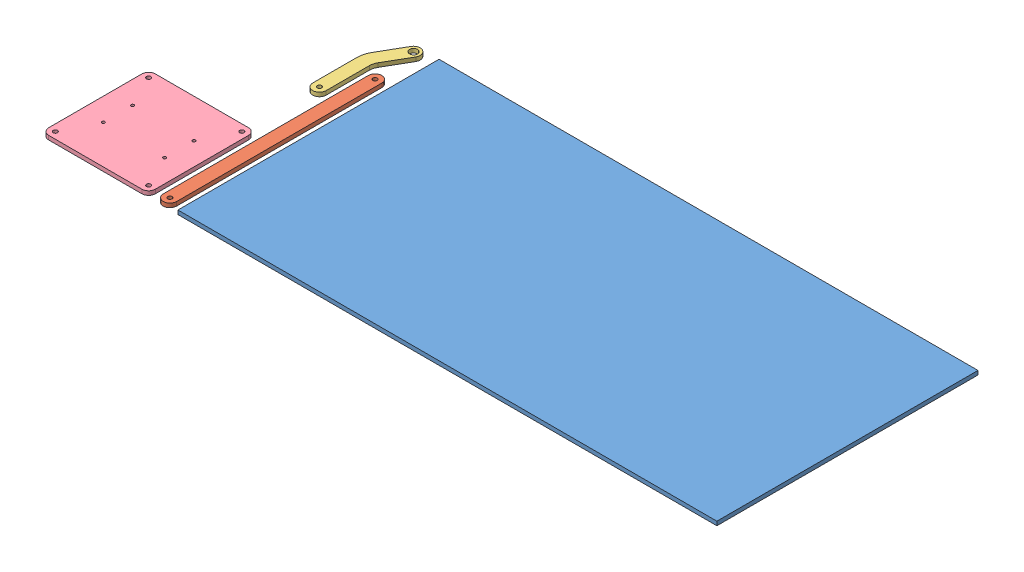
SolidWorks assembly Pièces PVC 3 gris à plat.SLDASM, configuration Défaut (file format 7000). Lengths in mm.
Overall size (506.56 3 196.36).
4 component instances, 4 part files, 8 mates.
Components (placement in the parent):
- Chaussée à plat-1: Chaussée à plat.SLDPRT [Défaut] at (-229.7196 -9.1576 503.06) size (404.56 3 196)
- Bielle de lisse-1: Bielle de lisse.SLDPRT [Défaut] at (-266.7196 -6.1576 524.06) x (0 0 -1) z (0 -1 0) size (164 10 3)
- Bielle de moteur-1: Bielle de moteur.SLDPRT [Défaut] at (-256.7196 -9.1576 333.3542) x (1 0 0) z (0 1 0) size (22.5 68.15 3)
- Platine Bouton poussoir-1: Platine Bouton poussoir.SLDPRT [Défaut] at (-291.7196 -9.1576 463.06) x (0 1 0) z (0 0 1) size (3 80 80)
Mates (geometry in assembly coordinates):
- Coïncidente2: coincident aligned: plane of Chaussée à plat-1 through (-229.7196 -6.1576 503.06) normal (0 1 0); plane of Bielle de lisse-1 through (-240.7196 -6.1576 344.06) normal (0 1 0)
- Distance2: distance = 6 mm anti-aligned: plane of Chaussée à plat-1 through (-229.7196 -6.1576 503.06) normal (-1 0 0); plane of Bielle de lisse-1 through (-235.7196 -9.1576 498.06) normal (1 0 0)
- Tangent1: tangent aligned: plane of Chaussée à plat-1 through (-229.7196 -6.1576 503.06) normal (0 0 1); cylinder of Bielle de lisse-1 through (-240.7196 -9.1576 498.06) axis (0 1 0) radius 5
- Coïncidente3: coincident aligned: plane of Chaussée à plat-1 through (-229.7196 -6.1576 503.06) normal (0 1 0); plane of Platine Bouton poussoir-1 through (-256.7196 -6.1576 498.06) normal (0 1 0)
- Coïncidente4: coincident aligned: plane of Chaussée à plat-1 through (-229.7196 -6.1576 503.06) normal (0 1 0); plane of Bielle de moteur-1 through (-256.7196 -6.1576 369.8542) normal (0 1 0)
- Distance3: distance = 6 mm anti-aligned: plane of Bielle de lisse-1 through (-245.7196 -9.1576 498.06) normal (-1 0 0); plane of Platine Bouton poussoir-1 through (-251.7196 -6.1576 428.06) normal (1 0 0)
- Coïncidente6: coincident aligned: plane of Chaussée à plat-1 through (-229.7196 -6.1576 503.06) normal (0 0 1); plane of Platine Bouton poussoir-1 through (-326.7196 -6.1576 503.06) normal (0 0 1)
- Coïncidente7: coincident aligned: plane of Bielle de moteur-1 through (-251.7196 -6.1576 369.8542) normal (1 0 0); plane of Platine Bouton poussoir-1 through (-251.7196 -6.1576 428.06) normal (1 0 0)
